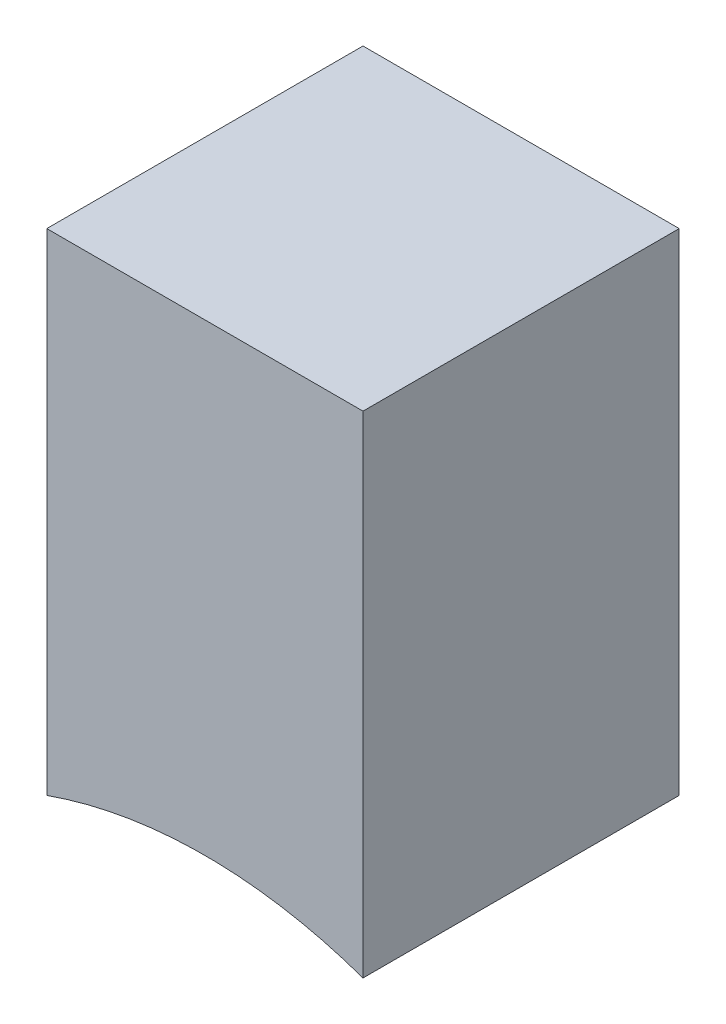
from build123d import *

# Parameters (mm, degrees)
BASE_EXTRUSION_DEPTH = 6


with BuildPart() as part:
    # Esquisse2 → Base-Extrusion (new body)
    with BuildSketch(Plane.XY):
        with BuildLine():
            Line((3, 42.577112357), (-3, 42.577112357))
            Line((-3, 42.577112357), (-3, 33.262393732))
            ThreePointArc((-3, 33.262393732), (0, 33.777112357), (3, 33.262393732))
            Line((3, 33.262393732), (3, 42.577112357))
        make_face()
    extrude(amount=BASE_EXTRUSION_DEPTH)


solid = part.part
